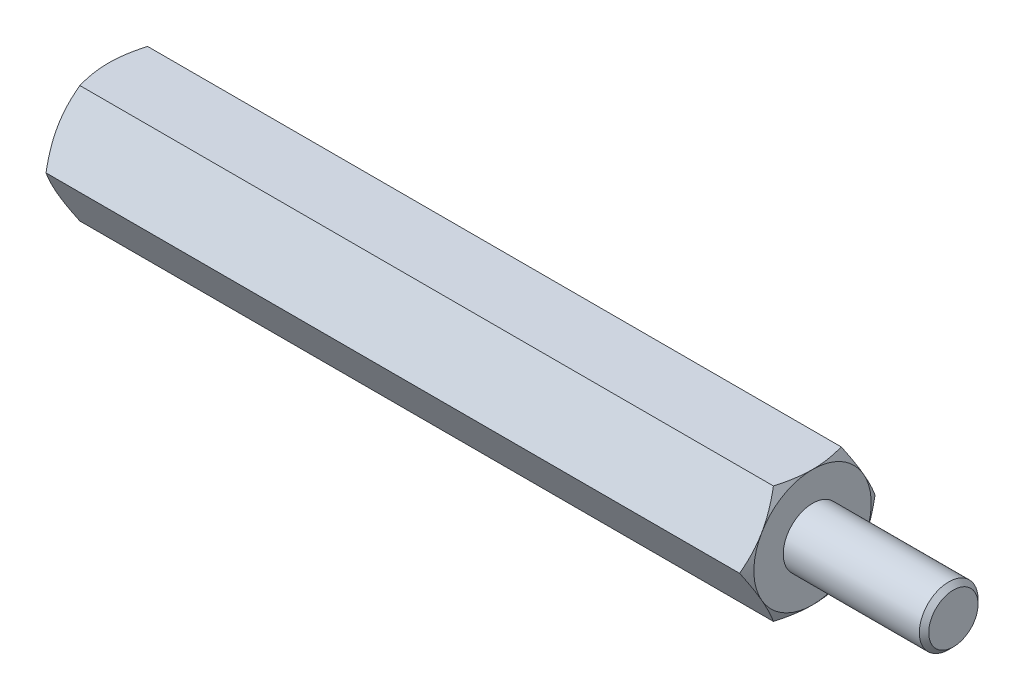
from build123d import *

# Parameters (mm, degrees)
EXTRUDE2_DEPTH = 15
SKETCH3_R      = 1.05
EXTRUDE3_DEPTH = 6
SKETCH5_R      = 1.25
EXTRUDE4_DEPTH = 6
CHAMFER1_SIZE  = 0.2


with BuildPart() as part:
    # Sketch1 → Extrude2 (new, symmetric)
    with BuildSketch(Plane(origin=(0, 0, 0), x_dir=(0, 0, -1), z_dir=(1, 0, 0))):
        Polygon((1.443375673, 2.5), (-1.443375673, 2.5), (-2.886751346, 0), (-1.443375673, -2.5), (1.443375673, -2.5), (2.886751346, 0), align=None)
    extrude(amount=EXTRUDE2_DEPTH, both=True)

    # Sketch2 → Cut-Revolve1 (revolve, cut)
    with BuildSketch(Plane.XY):
        with BuildLine():
            Line((-15, 2.5), (-13.5, 5.098076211))
            ThreePointArc((-13.5, 5.098076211), (-13.98810136, 6.276457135), (-15, 5.5))
            Line((-15, 5.5), (-15, 2.5))
        make_face()
    cut_revolve1 = revolve(axis=Axis((0, 0, 0), (1, 0, 0)), mode=Mode.SUBTRACT)

    # Mirror1: Cut-Revolve1 across plane
    add(cut_revolve1.mirror(Plane(origin=(0, 0, 0), x_dir=(0, 0, 1), z_dir=(1, 0, 0))), mode=Mode.SUBTRACT)

    # Sketch3 → Extrude3 (cut)
    with BuildSketch(Plane.ZY.offset(15)):
        Circle(SKETCH3_R)
    extrude(amount=-EXTRUDE3_DEPTH, mode=Mode.SUBTRACT)

    # Sketch4 → Cut-Revolve2 (revolve, cut)
    with BuildSketch(Plane.XY, mode=Mode.PRIVATE) as cut_revolve2_sk:
        Polygon((-9, 0), (-9, 1.05), (-8.393782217, 0), align=None)
    revolve(cut_revolve2_sk.sketch.rotate(Axis((-8.393782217, 0, 0), (-1, 0, 0)), 270), axis=Axis((-8.393782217, 0, 0), (-1, 0, 0)), mode=Mode.SUBTRACT)

    # Sketch5 → Extrude4 (add)
    with BuildSketch(Plane(origin=(15, 0, 0), x_dir=(0, 0, -1), z_dir=(1, 0, 0))):
        Circle(SKETCH5_R)
    extrude(amount=EXTRUDE4_DEPTH)

    # Chamfer1
    chamfer1_edges = [part.edges().sort_by_distance(p)[0] for p in [
        (21, 0, 1.25),
    ]]
    chamfer(chamfer1_edges, length=CHAMFER1_SIZE)


solid = part.part
